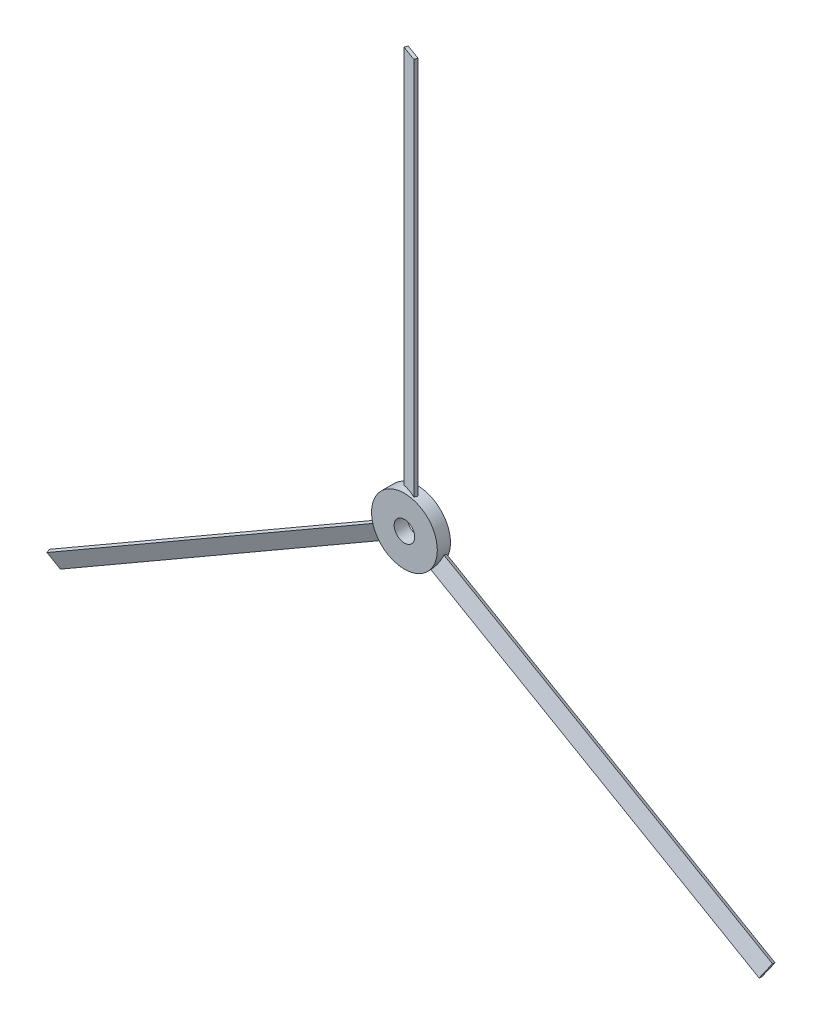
ISO-10303-21;
HEADER;
FILE_DESCRIPTION(('STEP AP214'),'2;1');
FILE_NAME('part.step','',(''),(''),'','','');
FILE_SCHEMA(('AUTOMOTIVE_DESIGN { 1 0 10303 214 1 1 1 1 }'));
ENDSEC;
DATA;
#1=APPLICATION_CONTEXT('core data for automotive mechanical design processes');
#2=APPLICATION_PROTOCOL_DEFINITION('international standard','automotive_design',2000,#1);
#3=PRODUCT_CONTEXT('',#1,'mechanical');
#4=PRODUCT('Part','Part','',(#3));
#5=PRODUCT_RELATED_PRODUCT_CATEGORY('part','',(#4));
#6=PRODUCT_DEFINITION_FORMATION('','',#4);
#7=PRODUCT_DEFINITION_CONTEXT('part definition',#1,'design');
#8=PRODUCT_DEFINITION('design','',#6,#7);
#9=PRODUCT_DEFINITION_SHAPE('','',#8);
#10=(LENGTH_UNIT() NAMED_UNIT(*) SI_UNIT(.MILLI.,.METRE.));
#11=(NAMED_UNIT(*) PLANE_ANGLE_UNIT() SI_UNIT($,.RADIAN.));
#12=(NAMED_UNIT(*) SI_UNIT($,.STERADIAN.) SOLID_ANGLE_UNIT());
#13=UNCERTAINTY_MEASURE_WITH_UNIT(LENGTH_MEASURE(1.E-05),#10,'distance_accuracy_value','');
#14=(GEOMETRIC_REPRESENTATION_CONTEXT(3) GLOBAL_UNCERTAINTY_ASSIGNED_CONTEXT((#13)) GLOBAL_UNIT_ASSIGNED_CONTEXT((#10,
#11,#12)) REPRESENTATION_CONTEXT('',''));
#15=CARTESIAN_POINT('',(0.,0.,0.));
#16=DIRECTION('',(0.,0.,1.));
#17=DIRECTION('',(1.,0.,0.));
#18=AXIS2_PLACEMENT_3D('',#15,#16,#17);
#19=CARTESIAN_POINT('',(0.,0.,80.));
#20=DIRECTION('',(0.,0.,-1.));
#21=DIRECTION('',(-1.,0.,0.));
#22=AXIS2_PLACEMENT_3D('',#19,#20,#21);
#23=CYLINDRICAL_SURFACE('',#22,400.);
#24=CARTESIAN_POINT('',(0.,0.,21.2835554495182));
#25=DIRECTION('',(-0.171010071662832,0.296198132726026,-0.939692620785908));
#26=DIRECTION('',(0.469846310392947,-0.813797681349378,-0.342020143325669));
#27=AXIS2_PLACEMENT_3D('',#24,#25,#26);
#28=ELLIPSE('',#27,425.671108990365,400.);
#29=CARTESIAN_POINT('',(-284.82353534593,-280.847919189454,-15.4081619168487));
#30=VERTEX_POINT('',#29);
#31=CARTESIAN_POINT('',(-381.656756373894,-119.741890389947,52.9958667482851));
#32=VERTEX_POINT('',#31);
#33=EDGE_CURVE('E213',#30,#32,#28,.T.);
#34=ORIENTED_EDGE('',*,*,#33,.F.);
#35=CARTESIAN_POINT('',(0.,0.,-292.380440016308));
#36=DIRECTION('',(-0.469846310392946,0.813797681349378,0.34202014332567));
#37=DIRECTION('',(-0.171010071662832,0.296198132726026,-0.939692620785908));
#38=AXIS2_PLACEMENT_3D('',#35,#36,#37);
#39=ELLIPSE('',#38,1169.52176006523,400.);
#40=CARTESIAN_POINT('',(-294.527897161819,-270.653501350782,-52.9958667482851));
#41=VERTEX_POINT('',#40);
#42=EDGE_CURVE('E140',#41,#30,#39,.T.);
#43=ORIENTED_EDGE('',*,*,#42,.F.);
#44=CARTESIAN_POINT('',(0.,0.,-21.2835554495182));
#45=DIRECTION('',(0.171010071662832,-0.296198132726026,0.939692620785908));
#46=DIRECTION('',(0.469846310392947,-0.813797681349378,-0.342020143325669));
#47=AXIS2_PLACEMENT_3D('',#44,#45,#46);
#48=ELLIPSE('',#47,425.671108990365,400.);
#49=CARTESIAN_POINT('',(-385.633200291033,-106.240457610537,15.4081619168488));
#50=VERTEX_POINT('',#49);
#51=EDGE_CURVE('E206',#50,#41,#48,.T.);
#52=ORIENTED_EDGE('',*,*,#51,.F.);
#53=CARTESIAN_POINT('',(0.,0.,292.380440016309));
#54=DIRECTION('',(0.469846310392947,-0.813797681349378,-0.342020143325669));
#55=DIRECTION('',(-0.171010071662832,0.296198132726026,-0.939692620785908));
#56=AXIS2_PLACEMENT_3D('',#53,#54,#55);
#57=ELLIPSE('',#56,1169.52176006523,400.);
#58=EDGE_CURVE('E209',#32,#50,#57,.T.);
#59=ORIENTED_EDGE('',*,*,#58,.F.);
#60=EDGE_LOOP('',(#34,#43,#52,#59));
#61=FACE_BOUND('',#60,.T.);
#62=CARTESIAN_POINT('',(0.,0.,-80.));
#63=DIRECTION('',(0.,0.,1.));
#64=DIRECTION('',(1.,0.,0.));
#65=AXIS2_PLACEMENT_3D('',#62,#63,#64);
#66=CIRCLE('',#65,400.);
#67=CARTESIAN_POINT('',(400.,0.,-80.));
#68=VERTEX_POINT('',#67);
#69=EDGE_CURVE('E188',#68,#68,#66,.T.);
#70=ORIENTED_EDGE('',*,*,#69,.T.);
#71=EDGE_LOOP('',(#70));
#72=FACE_BOUND('',#71,.T.);
#73=CARTESIAN_POINT('',(0.,0.,80.));
#74=DIRECTION('',(0.,0.,1.));
#75=DIRECTION('',(1.,0.,0.));
#76=AXIS2_PLACEMENT_3D('',#73,#74,#75);
#77=CIRCLE('',#76,400.);
#78=CARTESIAN_POINT('',(400.,0.,80.));
#79=VERTEX_POINT('',#78);
#80=EDGE_CURVE('E191',#79,#79,#77,.T.);
#81=ORIENTED_EDGE('',*,*,#80,.F.);
#82=EDGE_LOOP('',(#81));
#83=FACE_BOUND('',#82,.T.);
#84=CARTESIAN_POINT('',(0.,0.,-292.380440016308));
#85=DIRECTION('',(0.939692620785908,0.,0.342020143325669));
#86=DIRECTION('',(0.342020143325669,0.,-0.939692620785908));
#87=AXIS2_PLACEMENT_3D('',#84,#85,#86);
#88=ELLIPSE('',#87,1169.52176006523,400.);
#89=CARTESIAN_POINT('',(-87.1288592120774,390.395391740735,-52.9958667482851));
#90=VERTEX_POINT('',#89);
#91=CARTESIAN_POINT('',(-100.809664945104,387.088376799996,-15.4081619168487));
#92=VERTEX_POINT('',#91);
#93=EDGE_CURVE('E203',#90,#92,#88,.T.);
#94=ORIENTED_EDGE('',*,*,#93,.F.);
#95=CARTESIAN_POINT('',(0.,0.,-21.2835554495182));
#96=DIRECTION('',(-0.342020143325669,0.,0.939692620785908));
#97=DIRECTION('',(-0.939692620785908,0.,-0.342020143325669));
#98=AXIS2_PLACEMENT_3D('',#95,#96,#97);
#99=ELLIPSE('',#98,425.671108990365,400.);
#100=CARTESIAN_POINT('',(100.809664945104,387.088376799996,15.4081619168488));
#101=VERTEX_POINT('',#100);
#102=EDGE_CURVE('E194',#101,#90,#99,.T.);
#103=ORIENTED_EDGE('',*,*,#102,.F.);
#104=CARTESIAN_POINT('',(0.,0.,292.380440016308));
#105=DIRECTION('',(-0.939692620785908,0.,-0.342020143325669));
#106=DIRECTION('',(0.342020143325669,0.,-0.939692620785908));
#107=AXIS2_PLACEMENT_3D('',#104,#105,#106);
#108=ELLIPSE('',#107,1169.52176006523,400.);
#109=CARTESIAN_POINT('',(87.1288592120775,390.395391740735,52.9958667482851));
#110=VERTEX_POINT('',#109);
#111=EDGE_CURVE('E197',#110,#101,#108,.T.);
#112=ORIENTED_EDGE('',*,*,#111,.F.);
#113=CARTESIAN_POINT('',(0.,0.,21.2835554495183));
#114=DIRECTION('',(0.342020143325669,0.,-0.939692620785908));
#115=DIRECTION('',(-0.939692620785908,0.,-0.342020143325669));
#116=AXIS2_PLACEMENT_3D('',#113,#114,#115);
#117=ELLIPSE('',#116,425.671108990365,400.);
#118=EDGE_CURVE('E200',#92,#110,#117,.T.);
#119=ORIENTED_EDGE('',*,*,#118,.F.);
#120=EDGE_LOOP('',(#94,#103,#112,#119));
#121=FACE_BOUND('',#120,.T.);
#122=CARTESIAN_POINT('',(0.,0.,-21.2835554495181));
#123=DIRECTION('',(0.171010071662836,0.296198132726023,0.939692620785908));
#124=DIRECTION('',(0.469846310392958,0.813797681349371,-0.342020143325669));
#125=AXIS2_PLACEMENT_3D('',#122,#123,#124);
#126=ELLIPSE('',#125,425.671108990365,400.);
#127=CARTESIAN_POINT('',(284.823535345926,-280.847919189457,15.4081619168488));
#128=VERTEX_POINT('',#127);
#129=CARTESIAN_POINT('',(381.656756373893,-119.741890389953,-52.9958667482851));
#130=VERTEX_POINT('',#129);
#131=EDGE_CURVE('E11',#128,#130,#126,.T.);
#132=ORIENTED_EDGE('',*,*,#131,.F.);
#133=CARTESIAN_POINT('',(0.,0.,292.380440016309));
#134=DIRECTION('',(0.469846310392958,0.813797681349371,-0.342020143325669));
#135=DIRECTION('',(-0.171010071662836,-0.296198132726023,-0.939692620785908));
#136=AXIS2_PLACEMENT_3D('',#133,#134,#135);
#137=ELLIPSE('',#136,1169.52176006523,400.);
#138=CARTESIAN_POINT('',(294.527897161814,-270.653501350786,52.9958667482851));
#139=VERTEX_POINT('',#138);
#140=EDGE_CURVE('E215',#139,#128,#137,.T.);
#141=ORIENTED_EDGE('',*,*,#140,.F.);
#142=CARTESIAN_POINT('',(0.,0.,21.2835554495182));
#143=DIRECTION('',(-0.171010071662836,-0.296198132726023,-0.939692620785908));
#144=DIRECTION('',(0.469846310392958,0.813797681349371,-0.342020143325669));
#145=AXIS2_PLACEMENT_3D('',#142,#143,#144);
#146=ELLIPSE('',#145,425.671108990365,400.);
#147=CARTESIAN_POINT('',(385.633200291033,-106.240457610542,-15.4081619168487));
#148=VERTEX_POINT('',#147);
#149=EDGE_CURVE('E49',#148,#139,#146,.T.);
#150=ORIENTED_EDGE('',*,*,#149,.F.);
#151=CARTESIAN_POINT('',(0.,0.,-292.380440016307));
#152=DIRECTION('',(-0.469846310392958,-0.813797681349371,0.34202014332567));
#153=DIRECTION('',(-0.171010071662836,-0.296198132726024,-0.939692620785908));
#154=AXIS2_PLACEMENT_3D('',#151,#152,#153);
#155=ELLIPSE('',#154,1169.52176006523,400.);
#156=EDGE_CURVE('E39',#130,#148,#155,.T.);
#157=ORIENTED_EDGE('',*,*,#156,.F.);
#158=EDGE_LOOP('',(#132,#141,#150,#157));
#159=FACE_BOUND('',#158,.T.);
#160=ADVANCED_FACE('F32',(#61,#72,#83,#121,#159),#23,.T.);
#161=CARTESIAN_POINT('',(0.,0.,80.));
#162=DIRECTION('',(0.,0.,1.));
#163=DIRECTION('',(1.,0.,0.));
#164=AXIS2_PLACEMENT_3D('',#161,#162,#163);
#165=PLANE('',#164);
#166=CARTESIAN_POINT('',(0.,0.,80.));
#167=DIRECTION('',(0.,0.,1.));
#168=DIRECTION('',(1.,0.,0.));
#169=AXIS2_PLACEMENT_3D('',#166,#167,#168);
#170=CIRCLE('',#169,125.);
#171=CARTESIAN_POINT('',(125.,0.,80.));
#172=VERTEX_POINT('',#171);
#173=EDGE_CURVE('E296',#172,#172,#170,.T.);
#174=ORIENTED_EDGE('',*,*,#173,.F.);
#175=EDGE_LOOP('',(#174));
#176=FACE_BOUND('',#175,.T.);
#177=ORIENTED_EDGE('',*,*,#80,.T.);
#178=EDGE_LOOP('',(#177));
#179=FACE_BOUND('',#178,.T.);
#180=ADVANCED_FACE('F246',(#176,#179),#165,.T.);
#181=CARTESIAN_POINT('',(0.,0.,-80.));
#182=DIRECTION('',(0.,0.,1.));
#183=DIRECTION('',(1.,0.,0.));
#184=AXIS2_PLACEMENT_3D('',#181,#182,#183);
#185=PLANE('',#184);
#186=CARTESIAN_POINT('',(0.,0.,-80.));
#187=DIRECTION('',(0.,0.,1.));
#188=DIRECTION('',(1.,0.,0.));
#189=AXIS2_PLACEMENT_3D('',#186,#187,#188);
#190=CIRCLE('',#189,125.);
#191=CARTESIAN_POINT('',(125.,0.,-80.));
#192=VERTEX_POINT('',#191);
#193=EDGE_CURVE('E136',#192,#192,#190,.T.);
#194=ORIENTED_EDGE('',*,*,#193,.T.);
#195=EDGE_LOOP('',(#194));
#196=FACE_BOUND('',#195,.T.);
#197=ORIENTED_EDGE('',*,*,#69,.F.);
#198=EDGE_LOOP('',(#197));
#199=FACE_BOUND('',#198,.T.);
#200=ADVANCED_FACE('F253',(#196,#199),#185,.F.);
#201=CARTESIAN_POINT('',(-87.1288592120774,5000.,-52.9958667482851));
#202=DIRECTION('',(0.939692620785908,0.,0.342020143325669));
#203=DIRECTION('',(0.342020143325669,0.,-0.939692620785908));
#204=AXIS2_PLACEMENT_3D('',#201,#202,#203);
#205=PLANE('',#204);
#206=DIRECTION('',(0.,-1.,0.));
#207=VECTOR('',#206,1.);
#208=CARTESIAN_POINT('',(-87.1288592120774,5000.,-52.9958667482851));
#209=LINE('',#208,#207);
#210=CARTESIAN_POINT('',(-87.1288592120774,5000.,-52.9958667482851));
#211=VERTEX_POINT('',#210);
#212=EDGE_CURVE('E176',#211,#90,#209,.T.);
#213=ORIENTED_EDGE('',*,*,#212,.T.);
#214=ORIENTED_EDGE('',*,*,#93,.T.);
#215=DIRECTION('',(0.,-1.,0.));
#216=VECTOR('',#215,1.);
#217=CARTESIAN_POINT('',(-100.809664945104,5000.,-15.4081619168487));
#218=LINE('',#217,#216);
#219=CARTESIAN_POINT('',(-100.809664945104,5000.,-15.4081619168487));
#220=VERTEX_POINT('',#219);
#221=EDGE_CURVE('E185',#220,#92,#218,.T.);
#222=ORIENTED_EDGE('',*,*,#221,.F.);
#223=DIRECTION('',(-0.342020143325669,0.,0.939692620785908));
#224=VECTOR('',#223,1.);
#225=CARTESIAN_POINT('',(-87.1288592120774,5000.,-52.9958667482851));
#226=LINE('',#225,#224);
#227=EDGE_CURVE('E167',#211,#220,#226,.T.);
#228=ORIENTED_EDGE('',*,*,#227,.F.);
#229=EDGE_LOOP('',(#213,#214,#222,#228));
#230=FACE_BOUND('',#229,.T.);
#231=ADVANCED_FACE('F268',(#230),#205,.F.);
#232=CARTESIAN_POINT('',(-100.809664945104,5000.,-15.4081619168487));
#233=DIRECTION('',(0.342020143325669,0.,-0.939692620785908));
#234=DIRECTION('',(-0.939692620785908,0.,-0.342020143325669));
#235=AXIS2_PLACEMENT_3D('',#232,#233,#234);
#236=PLANE('',#235);
#237=ORIENTED_EDGE('',*,*,#221,.T.);
#238=ORIENTED_EDGE('',*,*,#118,.T.);
#239=DIRECTION('',(0.,-1.,0.));
#240=VECTOR('',#239,1.);
#241=CARTESIAN_POINT('',(87.1288592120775,5000.,52.9958667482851));
#242=LINE('',#241,#240);
#243=CARTESIAN_POINT('',(87.1288592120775,5000.,52.9958667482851));
#244=VERTEX_POINT('',#243);
#245=EDGE_CURVE('E182',#244,#110,#242,.T.);
#246=ORIENTED_EDGE('',*,*,#245,.F.);
#247=DIRECTION('',(0.939692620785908,0.,0.342020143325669));
#248=VECTOR('',#247,1.);
#249=CARTESIAN_POINT('',(-100.809664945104,5000.,-15.4081619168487));
#250=LINE('',#249,#248);
#251=EDGE_CURVE('E170',#220,#244,#250,.T.);
#252=ORIENTED_EDGE('',*,*,#251,.F.);
#253=EDGE_LOOP('',(#237,#238,#246,#252));
#254=FACE_BOUND('',#253,.T.);
#255=ADVANCED_FACE('F276',(#254),#236,.F.);
#256=CARTESIAN_POINT('',(87.1288592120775,5000.,52.9958667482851));
#257=DIRECTION('',(-0.939692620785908,0.,-0.342020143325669));
#258=DIRECTION('',(-0.342020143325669,0.,0.939692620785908));
#259=AXIS2_PLACEMENT_3D('',#256,#257,#258);
#260=PLANE('',#259);
#261=ORIENTED_EDGE('',*,*,#245,.T.);
#262=ORIENTED_EDGE('',*,*,#111,.T.);
#263=DIRECTION('',(0.,-1.,0.));
#264=VECTOR('',#263,1.);
#265=CARTESIAN_POINT('',(100.809664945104,5000.,15.4081619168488));
#266=LINE('',#265,#264);
#267=CARTESIAN_POINT('',(100.809664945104,5000.,15.4081619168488));
#268=VERTEX_POINT('',#267);
#269=EDGE_CURVE('E179',#268,#101,#266,.T.);
#270=ORIENTED_EDGE('',*,*,#269,.F.);
#271=DIRECTION('',(0.342020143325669,0.,-0.939692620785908));
#272=VECTOR('',#271,1.);
#273=CARTESIAN_POINT('',(87.1288592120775,5000.,52.9958667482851));
#274=LINE('',#273,#272);
#275=EDGE_CURVE('E172',#244,#268,#274,.T.);
#276=ORIENTED_EDGE('',*,*,#275,.F.);
#277=EDGE_LOOP('',(#261,#262,#270,#276));
#278=FACE_BOUND('',#277,.T.);
#279=ADVANCED_FACE('F274',(#278),#260,.F.);
#280=CARTESIAN_POINT('',(100.809664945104,5000.,15.4081619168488));
#281=DIRECTION('',(-0.342020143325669,0.,0.939692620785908));
#282=DIRECTION('',(0.939692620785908,0.,0.342020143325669));
#283=AXIS2_PLACEMENT_3D('',#280,#281,#282);
#284=PLANE('',#283);
#285=ORIENTED_EDGE('',*,*,#269,.T.);
#286=ORIENTED_EDGE('',*,*,#102,.T.);
#287=ORIENTED_EDGE('',*,*,#212,.F.);
#288=DIRECTION('',(-0.939692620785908,0.,-0.342020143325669));
#289=VECTOR('',#288,1.);
#290=CARTESIAN_POINT('',(100.809664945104,5000.,15.4081619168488));
#291=LINE('',#290,#289);
#292=EDGE_CURVE('E174',#268,#211,#291,.T.);
#293=ORIENTED_EDGE('',*,*,#292,.F.);
#294=EDGE_LOOP('',(#285,#286,#287,#293));
#295=FACE_BOUND('',#294,.T.);
#296=ADVANCED_FACE('F264',(#295),#284,.F.);
#297=CARTESIAN_POINT('',(-87.1288592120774,5000.,-52.9958667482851));
#298=DIRECTION('',(0.,-1.,0.));
#299=DIRECTION('',(0.,0.,-1.));
#300=AXIS2_PLACEMENT_3D('',#297,#298,#299);
#301=PLANE('',#300);
#302=ORIENTED_EDGE('',*,*,#227,.T.);
#303=ORIENTED_EDGE('',*,*,#251,.T.);
#304=ORIENTED_EDGE('',*,*,#275,.T.);
#305=ORIENTED_EDGE('',*,*,#292,.T.);
#306=EDGE_LOOP('',(#302,#303,#304,#305));
#307=FACE_BOUND('',#306,.T.);
#308=ADVANCED_FACE('F270',(#307),#301,.F.);
#309=CARTESIAN_POINT('',(-4286.56258931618,-2575.45580548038,-52.9958667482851));
#310=DIRECTION('',(0.866025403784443,0.499999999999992,0.));
#311=DIRECTION('',(0.,0.,-1.));
#312=AXIS2_PLACEMENT_3D('',#309,#310,#311);
#313=PLANE('',#312);
#314=DIRECTION('',(0.171010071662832,-0.296198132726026,0.939692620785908));
#315=VECTOR('',#314,1.);
#316=CARTESIAN_POINT('',(-4286.56258931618,-2575.45580548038,-52.9958667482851));
#317=LINE('',#316,#315);
#318=CARTESIAN_POINT('',(-4286.56258931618,-2575.45580548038,-52.9958667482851));
#319=VERTEX_POINT('',#318);
#320=CARTESIAN_POINT('',(-4279.72218644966,-2587.30373078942,-15.4081619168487));
#321=VERTEX_POINT('',#320);
#322=EDGE_CURVE('E127',#319,#321,#317,.T.);
#323=ORIENTED_EDGE('',*,*,#322,.T.);
#324=DIRECTION('',(-0.469846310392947,0.813797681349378,0.342020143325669));
#325=VECTOR('',#324,1.);
#326=CARTESIAN_POINT('',(-4279.72218644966,-2587.30373078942,-15.4081619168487));
#327=LINE('',#326,#325);
#328=CARTESIAN_POINT('',(-4373.69144852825,-2424.54419451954,52.9958667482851));
#329=VERTEX_POINT('',#328);
#330=EDGE_CURVE('E116',#321,#329,#327,.T.);
#331=ORIENTED_EDGE('',*,*,#330,.T.);
#332=DIRECTION('',(-0.171010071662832,0.296198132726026,-0.939692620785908));
#333=VECTOR('',#332,1.);
#334=CARTESIAN_POINT('',(-4373.69144852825,-2424.54419451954,52.9958667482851));
#335=LINE('',#334,#333);
#336=CARTESIAN_POINT('',(-4380.53185139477,-2412.6962692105,15.4081619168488));
#337=VERTEX_POINT('',#336);
#338=EDGE_CURVE('E126',#329,#337,#335,.T.);
#339=ORIENTED_EDGE('',*,*,#338,.T.);
#340=DIRECTION('',(0.469846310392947,-0.813797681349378,-0.342020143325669));
#341=VECTOR('',#340,1.);
#342=CARTESIAN_POINT('',(-4380.53185139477,-2412.6962692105,15.4081619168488));
#343=LINE('',#342,#341);
#344=EDGE_CURVE('E132',#337,#319,#343,.T.);
#345=ORIENTED_EDGE('',*,*,#344,.T.);
#346=EDGE_LOOP('',(#323,#331,#339,#345));
#347=FACE_BOUND('',#346,.T.);
#348=ADVANCED_FACE('F130',(#347),#313,.F.);
#349=CARTESIAN_POINT('',(-4380.53185139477,-2412.6962692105,15.4081619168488));
#350=DIRECTION('',(0.171010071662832,-0.296198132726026,0.939692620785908));
#351=DIRECTION('',(0.,-0.953741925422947,-0.300626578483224));
#352=AXIS2_PLACEMENT_3D('',#349,#350,#351);
#353=PLANE('',#352);
#354=DIRECTION('',(0.866025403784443,0.499999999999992,0.));
#355=VECTOR('',#354,1.);
#356=CARTESIAN_POINT('',(-4380.53185139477,-2412.6962692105,15.4081619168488));
#357=LINE('',#356,#355);
#358=EDGE_CURVE('E146',#337,#50,#357,.T.);
#359=ORIENTED_EDGE('',*,*,#358,.T.);
#360=ORIENTED_EDGE('',*,*,#51,.T.);
#361=DIRECTION('',(0.866025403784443,0.499999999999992,0.));
#362=VECTOR('',#361,1.);
#363=CARTESIAN_POINT('',(-4286.56258931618,-2575.45580548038,-52.9958667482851));
#364=LINE('',#363,#362);
#365=EDGE_CURVE('E303',#319,#41,#364,.T.);
#366=ORIENTED_EDGE('',*,*,#365,.F.);
#367=ORIENTED_EDGE('',*,*,#344,.F.);
#368=EDGE_LOOP('',(#359,#360,#366,#367));
#369=FACE_BOUND('',#368,.T.);
#370=ADVANCED_FACE('F307',(#369),#353,.F.);
#371=CARTESIAN_POINT('',(-4373.69144852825,-2424.54419451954,52.9958667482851));
#372=DIRECTION('',(0.469846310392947,-0.813797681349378,-0.342020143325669));
#373=DIRECTION('',(0.866025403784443,0.499999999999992,0.));
#374=AXIS2_PLACEMENT_3D('',#371,#372,#373);
#375=PLANE('',#374);
#376=DIRECTION('',(0.866025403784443,0.499999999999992,0.));
#377=VECTOR('',#376,1.);
#378=CARTESIAN_POINT('',(-4373.69144852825,-2424.54419451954,52.9958667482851));
#379=LINE('',#378,#377);
#380=EDGE_CURVE('E123',#329,#32,#379,.T.);
#381=ORIENTED_EDGE('',*,*,#380,.T.);
#382=ORIENTED_EDGE('',*,*,#58,.T.);
#383=ORIENTED_EDGE('',*,*,#358,.F.);
#384=ORIENTED_EDGE('',*,*,#338,.F.);
#385=EDGE_LOOP('',(#381,#382,#383,#384));
#386=FACE_BOUND('',#385,.T.);
#387=ADVANCED_FACE('F309',(#386),#375,.F.);
#388=CARTESIAN_POINT('',(-4286.56258931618,-2575.45580548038,-52.9958667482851));
#389=DIRECTION('',(-0.469846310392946,0.813797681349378,0.34202014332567));
#390=DIRECTION('',(-0.866025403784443,-0.499999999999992,0.));
#391=AXIS2_PLACEMENT_3D('',#388,#389,#390);
#392=PLANE('',#391);
#393=ORIENTED_EDGE('',*,*,#365,.T.);
#394=ORIENTED_EDGE('',*,*,#42,.T.);
#395=DIRECTION('',(0.866025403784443,0.499999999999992,0.));
#396=VECTOR('',#395,1.);
#397=CARTESIAN_POINT('',(-4279.72218644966,-2587.30373078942,-15.4081619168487));
#398=LINE('',#397,#396);
#399=EDGE_CURVE('E121',#321,#30,#398,.T.);
#400=ORIENTED_EDGE('',*,*,#399,.F.);
#401=ORIENTED_EDGE('',*,*,#322,.F.);
#402=EDGE_LOOP('',(#393,#394,#400,#401));
#403=FACE_BOUND('',#402,.T.);
#404=ADVANCED_FACE('F139',(#403),#392,.F.);
#405=CARTESIAN_POINT('',(-4279.72218644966,-2587.30373078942,-15.4081619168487));
#406=DIRECTION('',(-0.171010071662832,0.296198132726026,-0.939692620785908));
#407=DIRECTION('',(0.,0.953741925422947,0.300626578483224));
#408=AXIS2_PLACEMENT_3D('',#405,#406,#407);
#409=PLANE('',#408);
#410=ORIENTED_EDGE('',*,*,#399,.T.);
#411=ORIENTED_EDGE('',*,*,#33,.T.);
#412=ORIENTED_EDGE('',*,*,#380,.F.);
#413=ORIENTED_EDGE('',*,*,#330,.F.);
#414=EDGE_LOOP('',(#410,#411,#412,#413));
#415=FACE_BOUND('',#414,.T.);
#416=ADVANCED_FACE('F118',(#415),#409,.F.);
#417=CARTESIAN_POINT('',(4279.72218644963,-2587.30373078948,15.4081619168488));
#418=DIRECTION('',(0.171010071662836,0.296198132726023,0.939692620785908));
#419=DIRECTION('',(0.,-0.953741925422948,0.300626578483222));
#420=AXIS2_PLACEMENT_3D('',#417,#418,#419);
#421=PLANE('',#420);
#422=DIRECTION('',(-0.866025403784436,0.500000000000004,0.));
#423=VECTOR('',#422,1.);
#424=CARTESIAN_POINT('',(4279.72218644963,-2587.30373078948,15.4081619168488));
#425=LINE('',#424,#423);
#426=CARTESIAN_POINT('',(4279.72218644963,-2587.30373078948,15.4081619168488));
#427=VERTEX_POINT('',#426);
#428=EDGE_CURVE('E158',#427,#128,#425,.T.);
#429=ORIENTED_EDGE('',*,*,#428,.T.);
#430=ORIENTED_EDGE('',*,*,#131,.T.);
#431=DIRECTION('',(-0.866025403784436,0.500000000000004,0.));
#432=VECTOR('',#431,1.);
#433=CARTESIAN_POINT('',(4373.69144852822,-2424.5441945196,-52.9958667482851));
#434=LINE('',#433,#432);
#435=CARTESIAN_POINT('',(4373.69144852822,-2424.5441945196,-52.9958667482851));
#436=VERTEX_POINT('',#435);
#437=EDGE_CURVE('E155',#436,#130,#434,.T.);
#438=ORIENTED_EDGE('',*,*,#437,.F.);
#439=DIRECTION('',(0.469846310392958,0.813797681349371,-0.342020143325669));
#440=VECTOR('',#439,1.);
#441=CARTESIAN_POINT('',(4279.72218644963,-2587.30373078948,15.4081619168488));
#442=LINE('',#441,#440);
#443=EDGE_CURVE('E153',#427,#436,#442,.T.);
#444=ORIENTED_EDGE('',*,*,#443,.F.);
#445=EDGE_LOOP('',(#429,#430,#438,#444));
#446=FACE_BOUND('',#445,.T.);
#447=ADVANCED_FACE('F232',(#446),#421,.F.);
#448=CARTESIAN_POINT('',(4373.69144852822,-2424.5441945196,-52.9958667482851));
#449=DIRECTION('',(-0.469846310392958,-0.813797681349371,0.34202014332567));
#450=DIRECTION('',(0.866025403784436,-0.500000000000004,0.));
#451=AXIS2_PLACEMENT_3D('',#448,#449,#450);
#452=PLANE('',#451);
#453=ORIENTED_EDGE('',*,*,#437,.T.);
#454=ORIENTED_EDGE('',*,*,#156,.T.);
#455=DIRECTION('',(-0.866025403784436,0.500000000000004,0.));
#456=VECTOR('',#455,1.);
#457=CARTESIAN_POINT('',(4380.53185139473,-2412.69626921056,-15.4081619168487));
#458=LINE('',#457,#456);
#459=CARTESIAN_POINT('',(4380.53185139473,-2412.69626921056,-15.4081619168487));
#460=VERTEX_POINT('',#459);
#461=EDGE_CURVE('E164',#460,#148,#458,.T.);
#462=ORIENTED_EDGE('',*,*,#461,.F.);
#463=DIRECTION('',(0.171010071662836,0.296198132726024,0.939692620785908));
#464=VECTOR('',#463,1.);
#465=CARTESIAN_POINT('',(4373.69144852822,-2424.5441945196,-52.9958667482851));
#466=LINE('',#465,#464);
#467=EDGE_CURVE('E141',#436,#460,#466,.T.);
#468=ORIENTED_EDGE('',*,*,#467,.F.);
#469=EDGE_LOOP('',(#453,#454,#462,#468));
#470=FACE_BOUND('',#469,.T.);
#471=ADVANCED_FACE('F220',(#470),#452,.F.);
#472=CARTESIAN_POINT('',(4380.53185139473,-2412.69626921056,-15.4081619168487));
#473=DIRECTION('',(-0.171010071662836,-0.296198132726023,-0.939692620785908));
#474=DIRECTION('',(0.,0.953741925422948,-0.300626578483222));
#475=AXIS2_PLACEMENT_3D('',#472,#473,#474);
#476=PLANE('',#475);
#477=ORIENTED_EDGE('',*,*,#461,.T.);
#478=ORIENTED_EDGE('',*,*,#149,.T.);
#479=DIRECTION('',(-0.866025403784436,0.500000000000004,0.));
#480=VECTOR('',#479,1.);
#481=CARTESIAN_POINT('',(4286.56258931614,-2575.45580548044,52.9958667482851));
#482=LINE('',#481,#480);
#483=CARTESIAN_POINT('',(4286.56258931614,-2575.45580548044,52.9958667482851));
#484=VERTEX_POINT('',#483);
#485=EDGE_CURVE('E161',#484,#139,#482,.T.);
#486=ORIENTED_EDGE('',*,*,#485,.F.);
#487=DIRECTION('',(-0.469846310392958,-0.813797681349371,0.342020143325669));
#488=VECTOR('',#487,1.);
#489=CARTESIAN_POINT('',(4380.53185139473,-2412.69626921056,-15.4081619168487));
#490=LINE('',#489,#488);
#491=EDGE_CURVE('E144',#460,#484,#490,.T.);
#492=ORIENTED_EDGE('',*,*,#491,.F.);
#493=EDGE_LOOP('',(#477,#478,#486,#492));
#494=FACE_BOUND('',#493,.T.);
#495=ADVANCED_FACE('F224',(#494),#476,.F.);
#496=CARTESIAN_POINT('',(4286.56258931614,-2575.45580548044,52.9958667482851));
#497=DIRECTION('',(0.469846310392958,0.813797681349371,-0.342020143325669));
#498=DIRECTION('',(-0.866025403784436,0.500000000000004,0.));
#499=AXIS2_PLACEMENT_3D('',#496,#497,#498);
#500=PLANE('',#499);
#501=ORIENTED_EDGE('',*,*,#485,.T.);
#502=ORIENTED_EDGE('',*,*,#140,.T.);
#503=ORIENTED_EDGE('',*,*,#428,.F.);
#504=DIRECTION('',(-0.171010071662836,-0.296198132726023,-0.939692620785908));
#505=VECTOR('',#504,1.);
#506=CARTESIAN_POINT('',(4286.56258931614,-2575.45580548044,52.9958667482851));
#507=LINE('',#506,#505);
#508=EDGE_CURVE('E151',#484,#427,#507,.T.);
#509=ORIENTED_EDGE('',*,*,#508,.F.);
#510=EDGE_LOOP('',(#501,#502,#503,#509));
#511=FACE_BOUND('',#510,.T.);
#512=ADVANCED_FACE('F234',(#511),#500,.F.);
#513=CARTESIAN_POINT('',(4373.69144852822,-2424.5441945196,-52.9958667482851));
#514=DIRECTION('',(-0.866025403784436,0.500000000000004,0.));
#515=DIRECTION('',(0.,0.,-1.));
#516=AXIS2_PLACEMENT_3D('',#513,#514,#515);
#517=PLANE('',#516);
#518=ORIENTED_EDGE('',*,*,#467,.T.);
#519=ORIENTED_EDGE('',*,*,#491,.T.);
#520=ORIENTED_EDGE('',*,*,#508,.T.);
#521=ORIENTED_EDGE('',*,*,#443,.T.);
#522=EDGE_LOOP('',(#518,#519,#520,#521));
#523=FACE_BOUND('',#522,.T.);
#524=ADVANCED_FACE('F228',(#523),#517,.F.);
#525=CARTESIAN_POINT('',(0.,0.,-80.));
#526=DIRECTION('',(0.,0.,1.));
#527=DIRECTION('',(1.,0.,0.));
#528=AXIS2_PLACEMENT_3D('',#525,#526,#527);
#529=CYLINDRICAL_SURFACE('',#528,125.);
#530=ORIENTED_EDGE('',*,*,#193,.F.);
#531=EDGE_LOOP('',(#530));
#532=FACE_BOUND('',#531,.T.);
#533=ORIENTED_EDGE('',*,*,#173,.T.);
#534=EDGE_LOOP('',(#533));
#535=FACE_BOUND('',#534,.T.);
#536=ADVANCED_FACE('F241',(#532,#535),#529,.F.);
#537=CLOSED_SHELL('',(#160,#180,#200,#231,#255,#279,#296,#308,#348,#370,#387,#404,#416,#447,
#471,#495,#512,#524,#536));
#538=MANIFOLD_SOLID_BREP('B2',#537);
#539=ADVANCED_BREP_SHAPE_REPRESENTATION('',(#18,#538),#14);
#540=SHAPE_DEFINITION_REPRESENTATION(#9,#539);
ENDSEC;
END-ISO-10303-21;
